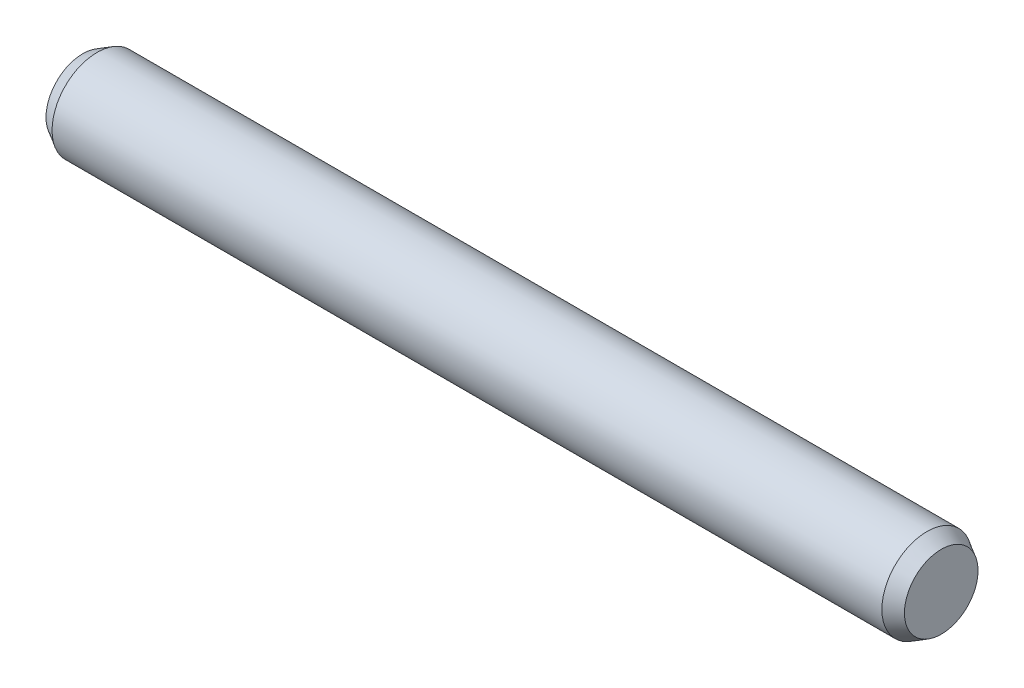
from build123d import *


with BuildPart() as part:
    # Sketch1 → Revolve1 (revolve)
    with BuildSketch(Plane.XY, mode=Mode.PRIVATE) as revolve1_sk:
        Polygon((0, 0), (15.24, 0), (15.24, 0.653353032), (14.986, 0.8), (0.254, 0.8), (0, 0.653353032), align=None)
    revolve(revolve1_sk.sketch.rotate(Axis((0, 0, 0), (1, 0, 0)), 90), axis=Axis((0, 0, 0), (1, 0, 0)))


solid = part.part
